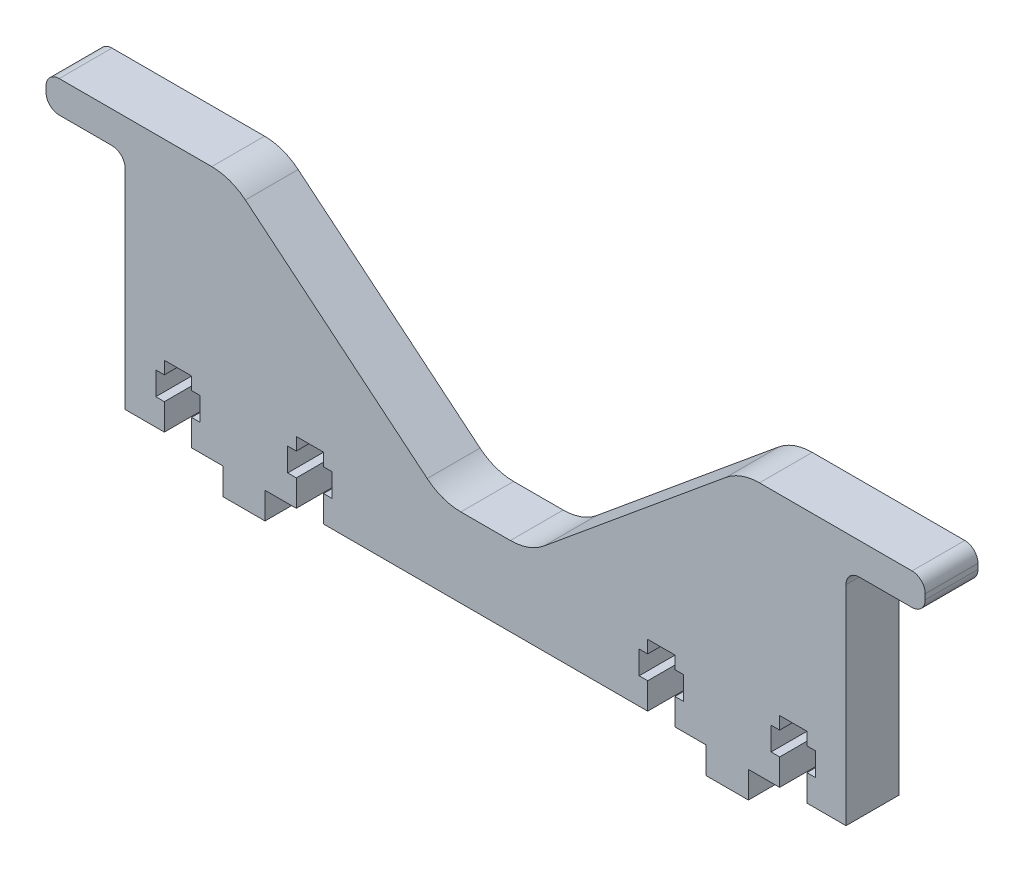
from build123d import *

# Parameters (mm, degrees)
BOSS_EXTRUDE1_DEPTH = 12.7
FILLET1_R           = 12.7
FILLET2_R           = 3.175
SKETCH3_R           = 3.25
CUT_EXTRUDE1_DEPTH  = 123.780551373
CUT_EXTRUDE2_DEPTH  = 123.780551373
SKETCH6_W           = 10.16
SKETCH6_H           = 6.4008
BOSS_EXTRUDE2_DEPTH = 12.7
SKETCH7_R           = 4.317647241
SKETCH7_R_2         = 5.169476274
SKETCH7_W           = 21.062530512
SKETCH7_H           = 16.408964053
SKETCH7_W_2         = 22.710860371
SKETCH7_H_2         = 19.117239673
BOSS_EXTRUDE3_DEPTH = 12.7


with BuildPart() as part:
    # Sketch1 → Boss-Extrude1 (new body)
    with BuildSketch(Plane.XY):
        Polygon((86.726, 0), (86.726, 53.414511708), (105.776, 53.414511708), (105.776, 61.034511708), (61.326, 61.034511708), (10.526, 19.05), (-10.526, 19.05), (-61.326, 61.034511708), (-105.776, 61.034511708), (-105.776, 53.414511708), (-86.726, 53.414511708), (-86.726, 0), align=None)
    extrude(amount=-BOSS_EXTRUDE1_DEPTH)

    # Fillet1
    fillet1_edges = [part.edges().sort_by_distance(p)[0] for p in [
        (-61.326, 61.034511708, -6.35),
        (-10.526, 19.05, -6.35),
        (10.526, 19.05, -6.35),
        (61.326, 61.034511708, -6.35),
    ]]
    fillet(fillet1_edges, radius=FILLET1_R)

    # Fillet2
    fillet2_edges = [part.edges().sort_by_distance(p)[0] for p in [
        (-86.726, 53.414511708, -6.35),
        (-105.776, 53.414511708, -6.35),
        (-105.776, 61.034511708, -6.35),
        (105.776, 61.034511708, -6.35),
        (105.776, 53.414511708, -6.35),
        (86.726, 53.414511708, -6.35),
    ]]
    fillet(fillet2_edges, radius=FILLET2_R)

    # Sketch3 → Cut-Extrude1 (cut, through all)
    with BuildSketch(Plane.XY):
        with Locations((80.376, 44.524511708)):
            Circle(SKETCH3_R)
        with Locations(Location((-80.376, 44.524511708, 0), (0, 0, 180))):
            Circle(SKETCH3_R)
    extrude(amount=-CUT_EXTRUDE1_DEPTH, mode=Mode.SUBTRACT)

    # Sketch4 → Cut-Extrude2 (cut, through all)
    with BuildSketch(Plane.XY):
        Polygon((86.726, 30.470361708), (80.376, 30.470361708), (80.376, 32.578561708), (74.788, 32.578561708), (74.788, 30.470361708), (67.168, 30.470361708), (67.168, 23.920361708), (74.788, 23.920361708), (74.788, 21.812161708), (80.376, 21.812161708), (80.376, 23.920361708), (86.726, 23.920361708), align=None)
        Polygon((77.3026, 0), (77.3026, 6.35), (79.36, 6.35), (79.36, 11.938), (77.3026, 11.938), (77.3026, 14.986), (70.7494, 14.986), (70.7494, 11.938), (68.692, 11.938), (68.692, 6.35), (70.7494, 6.35), (70.7494, 0), align=None)
        Polygon((-77.3026, 0), (-70.7494, 0), (-70.7494, 6.35), (-68.692, 6.35), (-68.692, 11.938), (-70.7494, 11.938), (-70.7494, 14.986), (-77.3026, 14.986), (-77.3026, 11.938), (-79.36, 11.938), (-79.36, 6.35), (-77.3026, 6.35), align=None)
        Polygon((-86.726, 30.470361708), (-86.726, 23.920361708), (-80.376, 23.920361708), (-80.376, 21.812161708), (-74.788, 21.812161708), (-74.788, 23.920361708), (-67.168, 23.920361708), (-67.168, 30.470361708), (-74.788, 30.470361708), (-74.788, 32.578561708), (-80.376, 32.578561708), (-80.376, 30.470361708), align=None)
        Polygon((38.9994, 0), (45.5526, 0), (45.5526, 6.35), (47.61, 6.35), (47.61, 11.938), (45.5526, 11.938), (45.5526, 14.986), (38.9994, 14.986), (38.9994, 11.938), (36.942, 11.938), (36.942, 6.35), (38.9994, 6.35), align=None)
        Polygon((-38.9994, 0), (-38.9994, 6.35), (-36.942, 6.35), (-36.942, 11.938), (-38.9994, 11.938), (-38.9994, 14.986), (-45.5526, 14.986), (-45.5526, 11.938), (-47.61, 11.938), (-47.61, 6.35), (-45.5526, 6.35), (-45.5526, 0), align=None)
    extrude(amount=-CUT_EXTRUDE2_DEPTH, mode=Mode.SUBTRACT)

    # Sketch6 → Boss-Extrude2 (add)
    with BuildSketch(Plane.XY):
        with Locations((-58.151, -3.2004)):
            Rectangle(SKETCH6_W, SKETCH6_H)
        with Locations((58.151, -3.2004)):
            Rectangle(SKETCH6_W, SKETCH6_H)
    extrude(amount=-BOSS_EXTRUDE2_DEPTH)

    # Sketch7 → Boss-Extrude3 (add)
    with BuildSketch(Plane.XY):
        with Locations((-80.376, 44.524511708)):
            Circle(SKETCH7_R)
        with Locations((80.376, 44.524511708)):
            Circle(SKETCH7_R_2)
        with Locations((-76.194734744, 28.193062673)):
            Rectangle(SKETCH7_W, SKETCH7_H)
        with Locations((75.370569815, 26.838924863)):
            Rectangle(SKETCH7_W_2, SKETCH7_H_2)
    extrude(amount=-BOSS_EXTRUDE3_DEPTH)


solid = part.part
